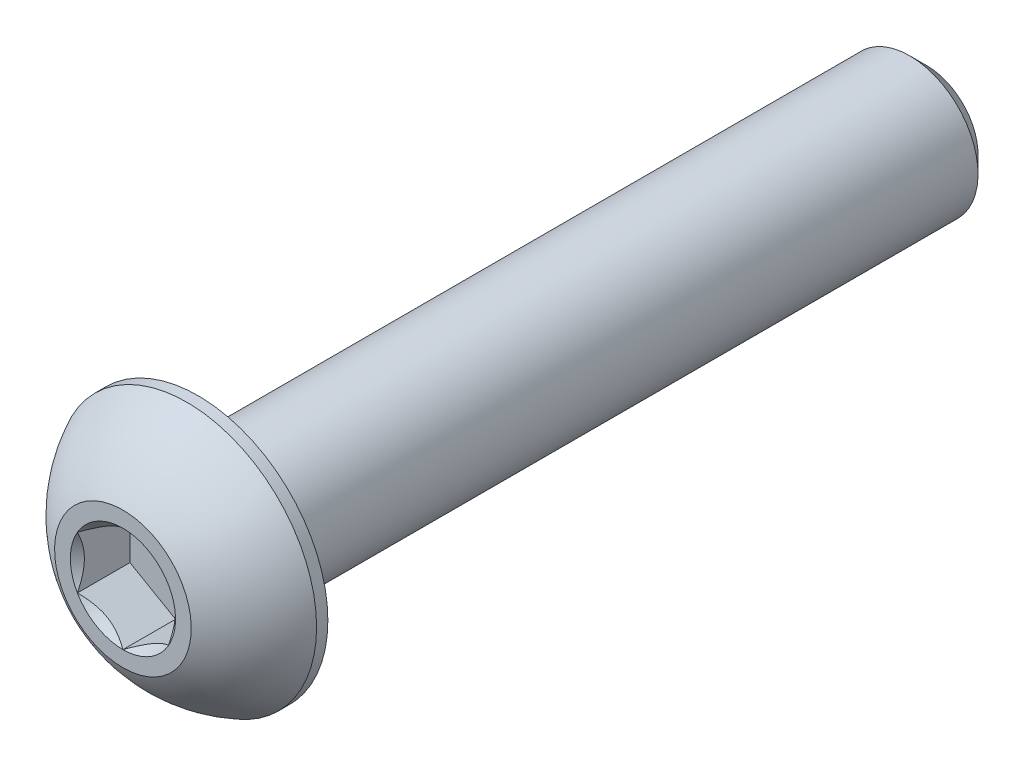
from build123d import *

# Parameters (mm, degrees)
SKETCH1_W          = 16
SKETCH1_H          = 1.5
CHAMFER1_SIZE      = 0.375
CUT_EXTRUDE2_DEPTH = 1.155


with BuildPart() as part:
    # Sketch1 → Revolve1 (revolve)
    with BuildSketch(Plane(origin=(0, 0, 0), x_dir=(0, 0, -1), z_dir=(1, 0, 0))):
        with Locations((9.65, 0.75)):
            Rectangle(SKETCH1_W, SKETCH1_H)
    revolve(axis=Axis((0, 0, -17.65), (0, 0, 1)))

    # Chamfer1
    chamfer1_edges = [part.edges().sort_by_distance(p)[0] for p in [
        (0, -1.5, -17.65),
    ]]
    chamfer(chamfer1_edges, length=CHAMFER1_SIZE)

    # Sketch7 → Revolve2 (revolve)
    with BuildSketch(Plane(origin=(0, 0, 0), x_dir=(0, 0, -1), z_dir=(1, 0, 0)), mode=Mode.PRIVATE) as revolve2_sk:
        with BuildLine():
            Line((1.4025, 2.85), (1.65, 2.85))
            Line((1.65, 2.85), (1.65, 0))
            Line((1.65, 0), (0, 0))
            Line((0, 0), (0, 1.5))
            ThreePointArc((0, 1.5), (0.59512511, 2.285251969), (1.4025, 2.85))
        make_face()
    revolve(revolve2_sk.sketch.rotate(Axis((0, 0, 0), (0, 0, -1)), 180), axis=Axis((0, 0, 0), (0, 0, -1)))

    # Sketch5 → Cut-Extrude2 (cut)
    with BuildSketch(Plane.XY):
        Polygon((1, -0.577350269), (1, 0.577350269), (0, 1.154700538), (-1, 0.577350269), (-1, -0.577350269), (0, -1.154700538), align=None)
    extrude(amount=-CUT_EXTRUDE2_DEPTH, mode=Mode.SUBTRACT)

    # Cut-Extrude3 cone 1 section (on through the dimple's axis) → Cut-Extrude3 (revolve, cut)
    with BuildSketch(Plane(origin=(0, 0, 0), x_dir=(0, -1, 0), z_dir=(1, 0, 0))):
        Polygon((0, 0), (1.154700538, 0), (0, 1.154700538), align=None)
    revolve(axis=Axis((0, 0, 0), (0, 0, -1)), mode=Mode.SUBTRACT)


solid = part.part
